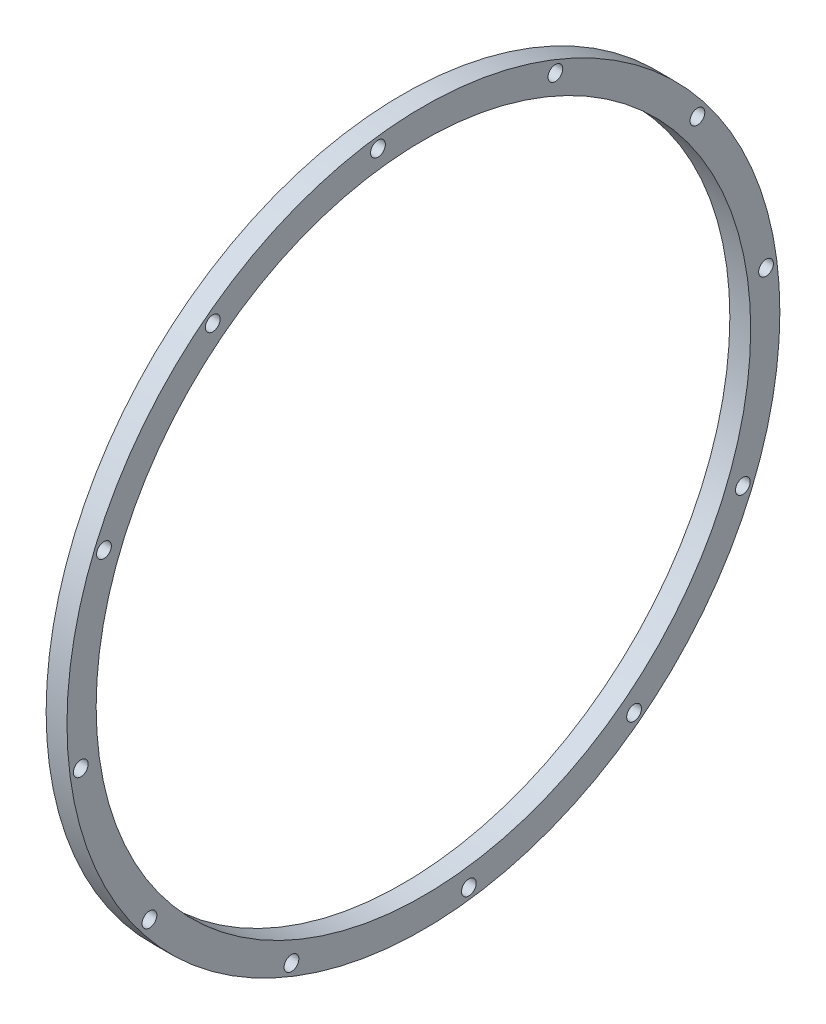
ISO-10303-21;
HEADER;
FILE_DESCRIPTION(('STEP AP214'),'2;1');
FILE_NAME('part.step','',(''),(''),'','','');
FILE_SCHEMA(('AUTOMOTIVE_DESIGN { 1 0 10303 214 1 1 1 1 }'));
ENDSEC;
DATA;
#1=APPLICATION_CONTEXT('core data for automotive mechanical design processes');
#2=APPLICATION_PROTOCOL_DEFINITION('international standard','automotive_design',2000,#1);
#3=PRODUCT_CONTEXT('',#1,'mechanical');
#4=PRODUCT('Part','Part','',(#3));
#5=PRODUCT_RELATED_PRODUCT_CATEGORY('part','',(#4));
#6=PRODUCT_DEFINITION_FORMATION('','',#4);
#7=PRODUCT_DEFINITION_CONTEXT('part definition',#1,'design');
#8=PRODUCT_DEFINITION('design','',#6,#7);
#9=PRODUCT_DEFINITION_SHAPE('','',#8);
#10=(LENGTH_UNIT() NAMED_UNIT(*) SI_UNIT(.MILLI.,.METRE.));
#11=(NAMED_UNIT(*) PLANE_ANGLE_UNIT() SI_UNIT($,.RADIAN.));
#12=(NAMED_UNIT(*) SI_UNIT($,.STERADIAN.) SOLID_ANGLE_UNIT());
#13=UNCERTAINTY_MEASURE_WITH_UNIT(LENGTH_MEASURE(1.E-05),#10,'distance_accuracy_value','');
#14=(GEOMETRIC_REPRESENTATION_CONTEXT(3) GLOBAL_UNCERTAINTY_ASSIGNED_CONTEXT((#13)) GLOBAL_UNIT_ASSIGNED_CONTEXT((#10,
#11,#12)) REPRESENTATION_CONTEXT('',''));
#15=CARTESIAN_POINT('',(0.,0.,0.));
#16=DIRECTION('',(0.,0.,1.));
#17=DIRECTION('',(1.,0.,0.));
#18=AXIS2_PLACEMENT_3D('',#15,#16,#17);
#19=CARTESIAN_POINT('',(6.35,0.,0.));
#20=DIRECTION('',(-1.,0.,0.));
#21=DIRECTION('',(0.,0.,1.));
#22=AXIS2_PLACEMENT_3D('',#19,#20,#21);
#23=CYLINDRICAL_SURFACE('',#22,108.585);
#24=CARTESIAN_POINT('',(6.35,0.,0.));
#25=DIRECTION('',(1.,0.,0.));
#26=DIRECTION('',(0.,0.,-1.));
#27=AXIS2_PLACEMENT_3D('',#24,#25,#26);
#28=CIRCLE('',#27,108.585);
#29=CARTESIAN_POINT('',(6.35,0.,-108.585));
#30=VERTEX_POINT('',#29);
#31=EDGE_CURVE('E10',#30,#30,#28,.T.);
#32=ORIENTED_EDGE('',*,*,#31,.F.);
#33=EDGE_LOOP('',(#32));
#34=FACE_BOUND('',#33,.T.);
#35=CARTESIAN_POINT('',(0.,0.,0.));
#36=DIRECTION('',(1.,0.,0.));
#37=DIRECTION('',(0.,0.,-1.));
#38=AXIS2_PLACEMENT_3D('',#35,#36,#37);
#39=CIRCLE('',#38,108.585);
#40=CARTESIAN_POINT('',(0.,0.,-108.585));
#41=VERTEX_POINT('',#40);
#42=EDGE_CURVE('E35',#41,#41,#39,.T.);
#43=ORIENTED_EDGE('',*,*,#42,.T.);
#44=EDGE_LOOP('',(#43));
#45=FACE_BOUND('',#44,.T.);
#46=ADVANCED_FACE('F32',(#34,#45),#23,.T.);
#47=CARTESIAN_POINT('',(6.35,0.,0.));
#48=DIRECTION('',(1.,0.,0.));
#49=DIRECTION('',(0.,0.,-1.));
#50=AXIS2_PLACEMENT_3D('',#47,#48,#49);
#51=PLANE('',#50);
#52=CARTESIAN_POINT('',(6.35,64.1715589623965,-83.4656882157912));
#53=DIRECTION('',(1.,0.,0.));
#54=DIRECTION('',(0.,0.,-1.));
#55=AXIS2_PLACEMENT_3D('',#52,#53,#54);
#56=CIRCLE('',#55,2.2479);
#57=CARTESIAN_POINT('',(6.35,64.1715589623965,-85.7135882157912));
#58=VERTEX_POINT('',#57);
#59=EDGE_CURVE('E118',#58,#58,#56,.T.);
#60=ORIENTED_EDGE('',*,*,#59,.F.);
#61=EDGE_LOOP('',(#60));
#62=FACE_BOUND('',#61,.T.);
#63=CARTESIAN_POINT('',(6.35,13.8413561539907,-104.369185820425));
#64=DIRECTION('',(1.,0.,0.));
#65=DIRECTION('',(0.,0.,-1.));
#66=AXIS2_PLACEMENT_3D('',#63,#64,#65);
#67=CIRCLE('',#66,2.2479);
#68=CARTESIAN_POINT('',(6.35,13.8413561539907,-106.617085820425));
#69=VERTEX_POINT('',#68);
#70=EDGE_CURVE('E112',#69,#69,#67,.T.);
#71=ORIENTED_EDGE('',*,*,#70,.F.);
#72=EDGE_LOOP('',(#71));
#73=FACE_BOUND('',#72,.T.);
#74=CARTESIAN_POINT('',(6.35,-40.1976268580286,-97.3070443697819));
#75=DIRECTION('',(1.,0.,0.));
#76=DIRECTION('',(0.,0.,-1.));
#77=AXIS2_PLACEMENT_3D('',#74,#75,#76);
#78=CIRCLE('',#77,2.2479);
#79=CARTESIAN_POINT('',(6.35,-40.1976268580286,-99.5549443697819));
#80=VERTEX_POINT('',#79);
#81=EDGE_CURVE('E106',#80,#80,#78,.T.);
#82=ORIENTED_EDGE('',*,*,#81,.F.);
#83=EDGE_LOOP('',(#82));
#84=FACE_BOUND('',#83,.T.);
#85=CARTESIAN_POINT('',(6.35,-83.4656882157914,-64.1715589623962));
#86=DIRECTION('',(1.,0.,0.));
#87=DIRECTION('',(0.,0.,-1.));
#88=AXIS2_PLACEMENT_3D('',#85,#86,#87);
#89=CIRCLE('',#88,2.2479);
#90=CARTESIAN_POINT('',(6.35,-83.4656882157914,-66.4194589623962));
#91=VERTEX_POINT('',#90);
#92=EDGE_CURVE('E100',#91,#91,#89,.T.);
#93=ORIENTED_EDGE('',*,*,#92,.F.);
#94=EDGE_LOOP('',(#93));
#95=FACE_BOUND('',#94,.T.);
#96=CARTESIAN_POINT('',(6.35,-104.369185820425,-13.8413561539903));
#97=DIRECTION('',(1.,0.,0.));
#98=DIRECTION('',(0.,0.,-1.));
#99=AXIS2_PLACEMENT_3D('',#96,#97,#98);
#100=CIRCLE('',#99,2.2479);
#101=CARTESIAN_POINT('',(6.35,-104.369185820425,-16.0892561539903));
#102=VERTEX_POINT('',#101);
#103=EDGE_CURVE('E94',#102,#102,#100,.T.);
#104=ORIENTED_EDGE('',*,*,#103,.F.);
#105=EDGE_LOOP('',(#104));
#106=FACE_BOUND('',#105,.T.);
#107=CARTESIAN_POINT('',(6.35,-97.3070443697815,40.1976268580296));
#108=DIRECTION('',(1.,0.,0.));
#109=DIRECTION('',(0.,0.,-1.));
#110=AXIS2_PLACEMENT_3D('',#107,#108,#109);
#111=CIRCLE('',#110,2.2479);
#112=CARTESIAN_POINT('',(6.35,-97.3070443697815,37.9497268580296));
#113=VERTEX_POINT('',#112);
#114=EDGE_CURVE('E88',#113,#113,#111,.T.);
#115=ORIENTED_EDGE('',*,*,#114,.F.);
#116=EDGE_LOOP('',(#115));
#117=FACE_BOUND('',#116,.T.);
#118=CARTESIAN_POINT('',(6.35,-64.171558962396,83.4656882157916));
#119=DIRECTION('',(1.,0.,0.));
#120=DIRECTION('',(0.,0.,-1.));
#121=AXIS2_PLACEMENT_3D('',#118,#119,#120);
#122=CIRCLE('',#121,2.2479);
#123=CARTESIAN_POINT('',(6.35,-64.171558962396,81.2177882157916));
#124=VERTEX_POINT('',#123);
#125=EDGE_CURVE('E82',#124,#124,#122,.T.);
#126=ORIENTED_EDGE('',*,*,#125,.F.);
#127=EDGE_LOOP('',(#126));
#128=FACE_BOUND('',#127,.T.);
#129=CARTESIAN_POINT('',(6.35,-13.84135615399,104.369185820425));
#130=DIRECTION('',(1.,0.,0.));
#131=DIRECTION('',(0.,0.,-1.));
#132=AXIS2_PLACEMENT_3D('',#129,#130,#131);
#133=CIRCLE('',#132,2.2479);
#134=CARTESIAN_POINT('',(6.35,-13.84135615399,102.121285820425));
#135=VERTEX_POINT('',#134);
#136=EDGE_CURVE('E76',#135,#135,#133,.T.);
#137=ORIENTED_EDGE('',*,*,#136,.F.);
#138=EDGE_LOOP('',(#137));
#139=FACE_BOUND('',#138,.T.);
#140=CARTESIAN_POINT('',(6.35,40.1976268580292,97.3070443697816));
#141=DIRECTION('',(1.,0.,0.));
#142=DIRECTION('',(0.,0.,-1.));
#143=AXIS2_PLACEMENT_3D('',#140,#141,#142);
#144=CIRCLE('',#143,2.2479);
#145=CARTESIAN_POINT('',(6.35,40.1976268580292,95.0591443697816));
#146=VERTEX_POINT('',#145);
#147=EDGE_CURVE('E70',#146,#146,#144,.T.);
#148=ORIENTED_EDGE('',*,*,#147,.F.);
#149=EDGE_LOOP('',(#148));
#150=FACE_BOUND('',#149,.T.);
#151=CARTESIAN_POINT('',(6.35,83.4656882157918,64.1715589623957));
#152=DIRECTION('',(1.,0.,0.));
#153=DIRECTION('',(0.,0.,-1.));
#154=AXIS2_PLACEMENT_3D('',#151,#152,#153);
#155=CIRCLE('',#154,2.2479);
#156=CARTESIAN_POINT('',(6.35,83.4656882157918,61.9236589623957));
#157=VERTEX_POINT('',#156);
#158=EDGE_CURVE('E64',#157,#157,#155,.T.);
#159=ORIENTED_EDGE('',*,*,#158,.F.);
#160=EDGE_LOOP('',(#159));
#161=FACE_BOUND('',#160,.T.);
#162=CARTESIAN_POINT('',(6.35,104.369185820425,13.8413561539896));
#163=DIRECTION('',(1.,0.,0.));
#164=DIRECTION('',(0.,0.,-1.));
#165=AXIS2_PLACEMENT_3D('',#162,#163,#164);
#166=CIRCLE('',#165,2.2479);
#167=CARTESIAN_POINT('',(6.35,104.369185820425,11.5934561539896));
#168=VERTEX_POINT('',#167);
#169=EDGE_CURVE('E58',#168,#168,#166,.T.);
#170=ORIENTED_EDGE('',*,*,#169,.F.);
#171=EDGE_LOOP('',(#170));
#172=FACE_BOUND('',#171,.T.);
#173=CARTESIAN_POINT('',(6.35,97.3070443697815,-40.1976268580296));
#174=DIRECTION('',(1.,0.,0.));
#175=DIRECTION('',(0.,0.,-1.));
#176=AXIS2_PLACEMENT_3D('',#173,#174,#175);
#177=CIRCLE('',#176,2.2479);
#178=CARTESIAN_POINT('',(6.35,97.3070443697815,-42.4455268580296));
#179=VERTEX_POINT('',#178);
#180=EDGE_CURVE('E52',#179,#179,#177,.T.);
#181=ORIENTED_EDGE('',*,*,#180,.F.);
#182=EDGE_LOOP('',(#181));
#183=FACE_BOUND('',#182,.T.);
#184=CARTESIAN_POINT('',(6.35,0.,0.));
#185=DIRECTION('',(1.,0.,0.));
#186=DIRECTION('',(0.,0.,-1.));
#187=AXIS2_PLACEMENT_3D('',#184,#185,#186);
#188=CIRCLE('',#187,99.695);
#189=CARTESIAN_POINT('',(6.35,0.,-99.695));
#190=VERTEX_POINT('',#189);
#191=EDGE_CURVE('E44',#190,#190,#188,.T.);
#192=ORIENTED_EDGE('',*,*,#191,.F.);
#193=EDGE_LOOP('',(#192));
#194=FACE_BOUND('',#193,.T.);
#195=ORIENTED_EDGE('',*,*,#31,.T.);
#196=EDGE_LOOP('',(#195));
#197=FACE_BOUND('',#196,.T.);
#198=ADVANCED_FACE('F124',(#62,#73,#84,#95,#106,#117,#128,#139,#150,#161,#172,#183,#194,#197),
#51,.T.);
#199=CARTESIAN_POINT('',(0.,0.,0.));
#200=DIRECTION('',(1.,0.,0.));
#201=DIRECTION('',(0.,0.,-1.));
#202=AXIS2_PLACEMENT_3D('',#199,#200,#201);
#203=PLANE('',#202);
#204=CARTESIAN_POINT('',(0.,64.1715589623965,-83.4656882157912));
#205=DIRECTION('',(1.,0.,0.));
#206=DIRECTION('',(0.,0.,-1.));
#207=AXIS2_PLACEMENT_3D('',#204,#205,#206);
#208=CIRCLE('',#207,2.2479);
#209=CARTESIAN_POINT('',(0.,64.1715589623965,-85.7135882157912));
#210=VERTEX_POINT('',#209);
#211=EDGE_CURVE('E115',#210,#210,#208,.T.);
#212=ORIENTED_EDGE('',*,*,#211,.T.);
#213=EDGE_LOOP('',(#212));
#214=FACE_BOUND('',#213,.T.);
#215=CARTESIAN_POINT('',(0.,13.8413561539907,-104.369185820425));
#216=DIRECTION('',(1.,0.,0.));
#217=DIRECTION('',(0.,0.,-1.));
#218=AXIS2_PLACEMENT_3D('',#215,#216,#217);
#219=CIRCLE('',#218,2.2479);
#220=CARTESIAN_POINT('',(0.,13.8413561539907,-106.617085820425));
#221=VERTEX_POINT('',#220);
#222=EDGE_CURVE('E109',#221,#221,#219,.T.);
#223=ORIENTED_EDGE('',*,*,#222,.T.);
#224=EDGE_LOOP('',(#223));
#225=FACE_BOUND('',#224,.T.);
#226=CARTESIAN_POINT('',(0.,-40.1976268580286,-97.3070443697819));
#227=DIRECTION('',(1.,0.,0.));
#228=DIRECTION('',(0.,0.,-1.));
#229=AXIS2_PLACEMENT_3D('',#226,#227,#228);
#230=CIRCLE('',#229,2.2479);
#231=CARTESIAN_POINT('',(0.,-40.1976268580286,-99.5549443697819));
#232=VERTEX_POINT('',#231);
#233=EDGE_CURVE('E103',#232,#232,#230,.T.);
#234=ORIENTED_EDGE('',*,*,#233,.T.);
#235=EDGE_LOOP('',(#234));
#236=FACE_BOUND('',#235,.T.);
#237=CARTESIAN_POINT('',(0.,-83.4656882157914,-64.1715589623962));
#238=DIRECTION('',(1.,0.,0.));
#239=DIRECTION('',(0.,0.,-1.));
#240=AXIS2_PLACEMENT_3D('',#237,#238,#239);
#241=CIRCLE('',#240,2.2479);
#242=CARTESIAN_POINT('',(0.,-83.4656882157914,-66.4194589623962));
#243=VERTEX_POINT('',#242);
#244=EDGE_CURVE('E97',#243,#243,#241,.T.);
#245=ORIENTED_EDGE('',*,*,#244,.T.);
#246=EDGE_LOOP('',(#245));
#247=FACE_BOUND('',#246,.T.);
#248=CARTESIAN_POINT('',(0.,-104.369185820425,-13.8413561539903));
#249=DIRECTION('',(1.,0.,0.));
#250=DIRECTION('',(0.,0.,-1.));
#251=AXIS2_PLACEMENT_3D('',#248,#249,#250);
#252=CIRCLE('',#251,2.2479);
#253=CARTESIAN_POINT('',(0.,-104.369185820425,-16.0892561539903));
#254=VERTEX_POINT('',#253);
#255=EDGE_CURVE('E91',#254,#254,#252,.T.);
#256=ORIENTED_EDGE('',*,*,#255,.T.);
#257=EDGE_LOOP('',(#256));
#258=FACE_BOUND('',#257,.T.);
#259=CARTESIAN_POINT('',(0.,-97.3070443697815,40.1976268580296));
#260=DIRECTION('',(1.,0.,0.));
#261=DIRECTION('',(0.,0.,-1.));
#262=AXIS2_PLACEMENT_3D('',#259,#260,#261);
#263=CIRCLE('',#262,2.2479);
#264=CARTESIAN_POINT('',(0.,-97.3070443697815,37.9497268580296));
#265=VERTEX_POINT('',#264);
#266=EDGE_CURVE('E85',#265,#265,#263,.T.);
#267=ORIENTED_EDGE('',*,*,#266,.T.);
#268=EDGE_LOOP('',(#267));
#269=FACE_BOUND('',#268,.T.);
#270=CARTESIAN_POINT('',(0.,-64.171558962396,83.4656882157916));
#271=DIRECTION('',(1.,0.,0.));
#272=DIRECTION('',(0.,0.,-1.));
#273=AXIS2_PLACEMENT_3D('',#270,#271,#272);
#274=CIRCLE('',#273,2.2479);
#275=CARTESIAN_POINT('',(0.,-64.171558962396,81.2177882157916));
#276=VERTEX_POINT('',#275);
#277=EDGE_CURVE('E79',#276,#276,#274,.T.);
#278=ORIENTED_EDGE('',*,*,#277,.T.);
#279=EDGE_LOOP('',(#278));
#280=FACE_BOUND('',#279,.T.);
#281=CARTESIAN_POINT('',(0.,-13.84135615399,104.369185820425));
#282=DIRECTION('',(1.,0.,0.));
#283=DIRECTION('',(0.,0.,-1.));
#284=AXIS2_PLACEMENT_3D('',#281,#282,#283);
#285=CIRCLE('',#284,2.2479);
#286=CARTESIAN_POINT('',(0.,-13.84135615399,102.121285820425));
#287=VERTEX_POINT('',#286);
#288=EDGE_CURVE('E73',#287,#287,#285,.T.);
#289=ORIENTED_EDGE('',*,*,#288,.T.);
#290=EDGE_LOOP('',(#289));
#291=FACE_BOUND('',#290,.T.);
#292=CARTESIAN_POINT('',(0.,40.1976268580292,97.3070443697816));
#293=DIRECTION('',(1.,0.,0.));
#294=DIRECTION('',(0.,0.,-1.));
#295=AXIS2_PLACEMENT_3D('',#292,#293,#294);
#296=CIRCLE('',#295,2.2479);
#297=CARTESIAN_POINT('',(0.,40.1976268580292,95.0591443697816));
#298=VERTEX_POINT('',#297);
#299=EDGE_CURVE('E67',#298,#298,#296,.T.);
#300=ORIENTED_EDGE('',*,*,#299,.T.);
#301=EDGE_LOOP('',(#300));
#302=FACE_BOUND('',#301,.T.);
#303=CARTESIAN_POINT('',(0.,83.4656882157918,64.1715589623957));
#304=DIRECTION('',(1.,0.,0.));
#305=DIRECTION('',(0.,0.,-1.));
#306=AXIS2_PLACEMENT_3D('',#303,#304,#305);
#307=CIRCLE('',#306,2.2479);
#308=CARTESIAN_POINT('',(0.,83.4656882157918,61.9236589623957));
#309=VERTEX_POINT('',#308);
#310=EDGE_CURVE('E61',#309,#309,#307,.T.);
#311=ORIENTED_EDGE('',*,*,#310,.T.);
#312=EDGE_LOOP('',(#311));
#313=FACE_BOUND('',#312,.T.);
#314=CARTESIAN_POINT('',(0.,104.369185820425,13.8413561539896));
#315=DIRECTION('',(1.,0.,0.));
#316=DIRECTION('',(0.,0.,-1.));
#317=AXIS2_PLACEMENT_3D('',#314,#315,#316);
#318=CIRCLE('',#317,2.2479);
#319=CARTESIAN_POINT('',(0.,104.369185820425,11.5934561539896));
#320=VERTEX_POINT('',#319);
#321=EDGE_CURVE('E55',#320,#320,#318,.T.);
#322=ORIENTED_EDGE('',*,*,#321,.T.);
#323=EDGE_LOOP('',(#322));
#324=FACE_BOUND('',#323,.T.);
#325=CARTESIAN_POINT('',(0.,97.3070443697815,-40.1976268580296));
#326=DIRECTION('',(1.,0.,0.));
#327=DIRECTION('',(0.,0.,-1.));
#328=AXIS2_PLACEMENT_3D('',#325,#326,#327);
#329=CIRCLE('',#328,2.2479);
#330=CARTESIAN_POINT('',(0.,97.3070443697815,-42.4455268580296));
#331=VERTEX_POINT('',#330);
#332=EDGE_CURVE('E47',#331,#331,#329,.T.);
#333=ORIENTED_EDGE('',*,*,#332,.T.);
#334=EDGE_LOOP('',(#333));
#335=FACE_BOUND('',#334,.T.);
#336=CARTESIAN_POINT('',(0.,0.,0.));
#337=DIRECTION('',(1.,0.,0.));
#338=DIRECTION('',(0.,0.,-1.));
#339=AXIS2_PLACEMENT_3D('',#336,#337,#338);
#340=CIRCLE('',#339,99.695);
#341=CARTESIAN_POINT('',(0.,0.,-99.695));
#342=VERTEX_POINT('',#341);
#343=EDGE_CURVE('E42',#342,#342,#340,.T.);
#344=ORIENTED_EDGE('',*,*,#343,.T.);
#345=EDGE_LOOP('',(#344));
#346=FACE_BOUND('',#345,.T.);
#347=ORIENTED_EDGE('',*,*,#42,.F.);
#348=EDGE_LOOP('',(#347));
#349=FACE_BOUND('',#348,.T.);
#350=ADVANCED_FACE('F127',(#214,#225,#236,#247,#258,#269,#280,#291,#302,#313,#324,#335,#346,
#349),#203,.F.);
#351=CARTESIAN_POINT('',(0.,0.,0.));
#352=DIRECTION('',(1.,0.,0.));
#353=DIRECTION('',(0.,0.,-1.));
#354=AXIS2_PLACEMENT_3D('',#351,#352,#353);
#355=CYLINDRICAL_SURFACE('',#354,99.695);
#356=ORIENTED_EDGE('',*,*,#343,.F.);
#357=EDGE_LOOP('',(#356));
#358=FACE_BOUND('',#357,.T.);
#359=ORIENTED_EDGE('',*,*,#191,.T.);
#360=EDGE_LOOP('',(#359));
#361=FACE_BOUND('',#360,.T.);
#362=ADVANCED_FACE('F153',(#358,#361),#355,.F.);
#363=CARTESIAN_POINT('',(6.35,97.3070443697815,-40.1976268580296));
#364=DIRECTION('',(1.,0.,0.));
#365=DIRECTION('',(0.,0.,-1.));
#366=AXIS2_PLACEMENT_3D('',#363,#364,#365);
#367=CYLINDRICAL_SURFACE('',#366,2.2479);
#368=ORIENTED_EDGE('',*,*,#332,.F.);
#369=EDGE_LOOP('',(#368));
#370=FACE_BOUND('',#369,.T.);
#371=ORIENTED_EDGE('',*,*,#180,.T.);
#372=EDGE_LOOP('',(#371));
#373=FACE_BOUND('',#372,.T.);
#374=ADVANCED_FACE('F155',(#370,#373),#367,.F.);
#375=CARTESIAN_POINT('',(6.35,104.369185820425,13.8413561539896));
#376=DIRECTION('',(1.,0.,0.));
#377=DIRECTION('',(0.,0.,-1.));
#378=AXIS2_PLACEMENT_3D('',#375,#376,#377);
#379=CYLINDRICAL_SURFACE('',#378,2.2479);
#380=ORIENTED_EDGE('',*,*,#321,.F.);
#381=EDGE_LOOP('',(#380));
#382=FACE_BOUND('',#381,.T.);
#383=ORIENTED_EDGE('',*,*,#169,.T.);
#384=EDGE_LOOP('',(#383));
#385=FACE_BOUND('',#384,.T.);
#386=ADVANCED_FACE('F162',(#382,#385),#379,.F.);
#387=CARTESIAN_POINT('',(6.35,83.4656882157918,64.1715589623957));
#388=DIRECTION('',(1.,0.,0.));
#389=DIRECTION('',(0.,0.,-1.));
#390=AXIS2_PLACEMENT_3D('',#387,#388,#389);
#391=CYLINDRICAL_SURFACE('',#390,2.2479);
#392=ORIENTED_EDGE('',*,*,#310,.F.);
#393=EDGE_LOOP('',(#392));
#394=FACE_BOUND('',#393,.T.);
#395=ORIENTED_EDGE('',*,*,#158,.T.);
#396=EDGE_LOOP('',(#395));
#397=FACE_BOUND('',#396,.T.);
#398=ADVANCED_FACE('F193',(#394,#397),#391,.F.);
#399=CARTESIAN_POINT('',(6.35,40.1976268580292,97.3070443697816));
#400=DIRECTION('',(1.,0.,0.));
#401=DIRECTION('',(0.,0.,-1.));
#402=AXIS2_PLACEMENT_3D('',#399,#400,#401);
#403=CYLINDRICAL_SURFACE('',#402,2.2479);
#404=ORIENTED_EDGE('',*,*,#299,.F.);
#405=EDGE_LOOP('',(#404));
#406=FACE_BOUND('',#405,.T.);
#407=ORIENTED_EDGE('',*,*,#147,.T.);
#408=EDGE_LOOP('',(#407));
#409=FACE_BOUND('',#408,.T.);
#410=ADVANCED_FACE('F204',(#406,#409),#403,.F.);
#411=CARTESIAN_POINT('',(6.35,-13.84135615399,104.369185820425));
#412=DIRECTION('',(1.,0.,0.));
#413=DIRECTION('',(0.,0.,-1.));
#414=AXIS2_PLACEMENT_3D('',#411,#412,#413);
#415=CYLINDRICAL_SURFACE('',#414,2.2479);
#416=ORIENTED_EDGE('',*,*,#288,.F.);
#417=EDGE_LOOP('',(#416));
#418=FACE_BOUND('',#417,.T.);
#419=ORIENTED_EDGE('',*,*,#136,.T.);
#420=EDGE_LOOP('',(#419));
#421=FACE_BOUND('',#420,.T.);
#422=ADVANCED_FACE('F214',(#418,#421),#415,.F.);
#423=CARTESIAN_POINT('',(6.35,-64.171558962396,83.4656882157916));
#424=DIRECTION('',(1.,0.,0.));
#425=DIRECTION('',(0.,0.,-1.));
#426=AXIS2_PLACEMENT_3D('',#423,#424,#425);
#427=CYLINDRICAL_SURFACE('',#426,2.2479);
#428=ORIENTED_EDGE('',*,*,#277,.F.);
#429=EDGE_LOOP('',(#428));
#430=FACE_BOUND('',#429,.T.);
#431=ORIENTED_EDGE('',*,*,#125,.T.);
#432=EDGE_LOOP('',(#431));
#433=FACE_BOUND('',#432,.T.);
#434=ADVANCED_FACE('F224',(#430,#433),#427,.F.);
#435=CARTESIAN_POINT('',(6.35,-97.3070443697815,40.1976268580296));
#436=DIRECTION('',(1.,0.,0.));
#437=DIRECTION('',(0.,0.,-1.));
#438=AXIS2_PLACEMENT_3D('',#435,#436,#437);
#439=CYLINDRICAL_SURFACE('',#438,2.2479);
#440=ORIENTED_EDGE('',*,*,#266,.F.);
#441=EDGE_LOOP('',(#440));
#442=FACE_BOUND('',#441,.T.);
#443=ORIENTED_EDGE('',*,*,#114,.T.);
#444=EDGE_LOOP('',(#443));
#445=FACE_BOUND('',#444,.T.);
#446=ADVANCED_FACE('F234',(#442,#445),#439,.F.);
#447=CARTESIAN_POINT('',(6.35,-104.369185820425,-13.8413561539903));
#448=DIRECTION('',(1.,0.,0.));
#449=DIRECTION('',(0.,0.,-1.));
#450=AXIS2_PLACEMENT_3D('',#447,#448,#449);
#451=CYLINDRICAL_SURFACE('',#450,2.2479);
#452=ORIENTED_EDGE('',*,*,#255,.F.);
#453=EDGE_LOOP('',(#452));
#454=FACE_BOUND('',#453,.T.);
#455=ORIENTED_EDGE('',*,*,#103,.T.);
#456=EDGE_LOOP('',(#455));
#457=FACE_BOUND('',#456,.T.);
#458=ADVANCED_FACE('F244',(#454,#457),#451,.F.);
#459=CARTESIAN_POINT('',(6.35,-83.4656882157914,-64.1715589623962));
#460=DIRECTION('',(1.,0.,0.));
#461=DIRECTION('',(0.,0.,-1.));
#462=AXIS2_PLACEMENT_3D('',#459,#460,#461);
#463=CYLINDRICAL_SURFACE('',#462,2.2479);
#464=ORIENTED_EDGE('',*,*,#244,.F.);
#465=EDGE_LOOP('',(#464));
#466=FACE_BOUND('',#465,.T.);
#467=ORIENTED_EDGE('',*,*,#92,.T.);
#468=EDGE_LOOP('',(#467));
#469=FACE_BOUND('',#468,.T.);
#470=ADVANCED_FACE('F254',(#466,#469),#463,.F.);
#471=CARTESIAN_POINT('',(6.35,-40.1976268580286,-97.3070443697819));
#472=DIRECTION('',(1.,0.,0.));
#473=DIRECTION('',(0.,0.,-1.));
#474=AXIS2_PLACEMENT_3D('',#471,#472,#473);
#475=CYLINDRICAL_SURFACE('',#474,2.2479);
#476=ORIENTED_EDGE('',*,*,#233,.F.);
#477=EDGE_LOOP('',(#476));
#478=FACE_BOUND('',#477,.T.);
#479=ORIENTED_EDGE('',*,*,#81,.T.);
#480=EDGE_LOOP('',(#479));
#481=FACE_BOUND('',#480,.T.);
#482=ADVANCED_FACE('F264',(#478,#481),#475,.F.);
#483=CARTESIAN_POINT('',(6.35,13.8413561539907,-104.369185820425));
#484=DIRECTION('',(1.,0.,0.));
#485=DIRECTION('',(0.,0.,-1.));
#486=AXIS2_PLACEMENT_3D('',#483,#484,#485);
#487=CYLINDRICAL_SURFACE('',#486,2.2479);
#488=ORIENTED_EDGE('',*,*,#222,.F.);
#489=EDGE_LOOP('',(#488));
#490=FACE_BOUND('',#489,.T.);
#491=ORIENTED_EDGE('',*,*,#70,.T.);
#492=EDGE_LOOP('',(#491));
#493=FACE_BOUND('',#492,.T.);
#494=ADVANCED_FACE('F274',(#490,#493),#487,.F.);
#495=CARTESIAN_POINT('',(6.35,64.1715589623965,-83.4656882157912));
#496=DIRECTION('',(1.,0.,0.));
#497=DIRECTION('',(0.,0.,-1.));
#498=AXIS2_PLACEMENT_3D('',#495,#496,#497);
#499=CYLINDRICAL_SURFACE('',#498,2.2479);
#500=ORIENTED_EDGE('',*,*,#211,.F.);
#501=EDGE_LOOP('',(#500));
#502=FACE_BOUND('',#501,.T.);
#503=ORIENTED_EDGE('',*,*,#59,.T.);
#504=EDGE_LOOP('',(#503));
#505=FACE_BOUND('',#504,.T.);
#506=ADVANCED_FACE('F122',(#502,#505),#499,.F.);
#507=CLOSED_SHELL('',(#46,#198,#350,#362,#374,#386,#398,#410,#422,#434,#446,#458,#470,#482,#494,#506));
#508=MANIFOLD_SOLID_BREP('B2',#507);
#509=ADVANCED_BREP_SHAPE_REPRESENTATION('',(#18,#508),#14);
#510=SHAPE_DEFINITION_REPRESENTATION(#9,#509);
ENDSEC;
END-ISO-10303-21;
